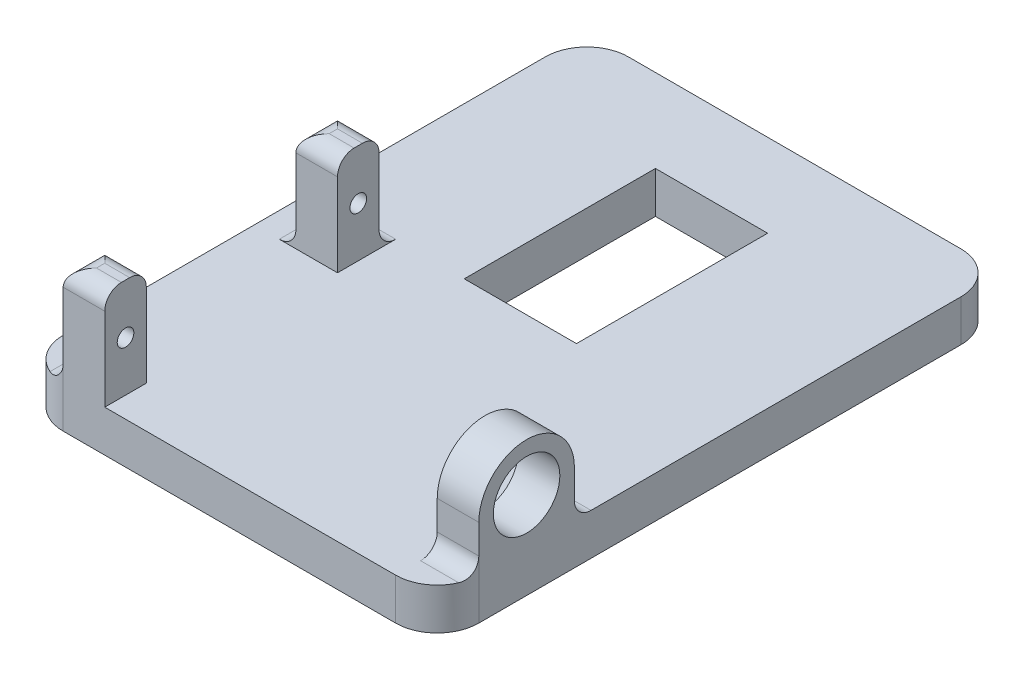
ISO-10303-21;
HEADER;
FILE_DESCRIPTION(('STEP AP214'),'2;1');
FILE_NAME('part.step','',(''),(''),'','','');
FILE_SCHEMA(('AUTOMOTIVE_DESIGN { 1 0 10303 214 1 1 1 1 }'));
ENDSEC;
DATA;
#1=APPLICATION_CONTEXT('core data for automotive mechanical design processes');
#2=APPLICATION_PROTOCOL_DEFINITION('international standard','automotive_design',2000,#1);
#3=PRODUCT_CONTEXT('',#1,'mechanical');
#4=PRODUCT('Part','Part','',(#3));
#5=PRODUCT_RELATED_PRODUCT_CATEGORY('part','',(#4));
#6=PRODUCT_DEFINITION_FORMATION('','',#4);
#7=PRODUCT_DEFINITION_CONTEXT('part definition',#1,'design');
#8=PRODUCT_DEFINITION('design','',#6,#7);
#9=PRODUCT_DEFINITION_SHAPE('','',#8);
#10=(LENGTH_UNIT() NAMED_UNIT(*) SI_UNIT(.MILLI.,.METRE.));
#11=(NAMED_UNIT(*) PLANE_ANGLE_UNIT() SI_UNIT($,.RADIAN.));
#12=(NAMED_UNIT(*) SI_UNIT($,.STERADIAN.) SOLID_ANGLE_UNIT());
#13=UNCERTAINTY_MEASURE_WITH_UNIT(LENGTH_MEASURE(1.E-05),#10,'distance_accuracy_value','');
#14=(GEOMETRIC_REPRESENTATION_CONTEXT(3) GLOBAL_UNCERTAINTY_ASSIGNED_CONTEXT((#13)) GLOBAL_UNIT_ASSIGNED_CONTEXT((#10,
#11,#12)) REPRESENTATION_CONTEXT('',''));
#15=CARTESIAN_POINT('',(0.,0.,0.));
#16=DIRECTION('',(0.,0.,1.));
#17=DIRECTION('',(1.,0.,0.));
#18=AXIS2_PLACEMENT_3D('',#15,#16,#17);
#19=CARTESIAN_POINT('',(0.,5.,0.));
#20=DIRECTION('',(0.,1.,0.));
#21=DIRECTION('',(0.,0.,1.));
#22=AXIS2_PLACEMENT_3D('',#19,#20,#21);
#23=PLANE('',#22);
#24=CARTESIAN_POINT('',(20.,5.,35.75));
#25=DIRECTION('',(0.,1.,0.));
#26=DIRECTION('',(0.,0.,1.));
#27=AXIS2_PLACEMENT_3D('',#24,#25,#26);
#28=CIRCLE('',#27,5.);
#29=CARTESIAN_POINT('',(20.,5.,40.75));
#30=VERTEX_POINT('',#29);
#31=CARTESIAN_POINT('',(24.5825756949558,5.,37.75));
#32=VERTEX_POINT('',#31);
#33=EDGE_CURVE('E407',#30,#32,#28,.T.);
#34=ORIENTED_EDGE('',*,*,#33,.T.);
#35=DIRECTION('',(1.,0.,0.));
#36=VECTOR('',#35,1.);
#37=CARTESIAN_POINT('',(20.,5.,37.75));
#38=LINE('',#37,#36);
#39=CARTESIAN_POINT('',(20.,5.,37.75));
#40=VERTEX_POINT('',#39);
#41=EDGE_CURVE('E583',#32,#40,#38,.F.);
#42=ORIENTED_EDGE('',*,*,#41,.T.);
#43=DIRECTION('',(0.,0.,-1.));
#44=VECTOR('',#43,1.);
#45=CARTESIAN_POINT('',(20.,5.,35.75));
#46=LINE('',#45,#44);
#47=CARTESIAN_POINT('',(20.,5.,22.25));
#48=VERTEX_POINT('',#47);
#49=EDGE_CURVE('E248',#40,#48,#46,.T.);
#50=ORIENTED_EDGE('',*,*,#49,.T.);
#51=DIRECTION('',(1.,0.,0.));
#52=VECTOR('',#51,1.);
#53=CARTESIAN_POINT('',(25.,5.,22.25));
#54=LINE('',#53,#52);
#55=CARTESIAN_POINT('',(25.,5.,22.25));
#56=VERTEX_POINT('',#55);
#57=EDGE_CURVE('E581',#48,#56,#54,.T.);
#58=ORIENTED_EDGE('',*,*,#57,.T.);
#59=DIRECTION('',(0.,0.,-1.));
#60=VECTOR('',#59,1.);
#61=CARTESIAN_POINT('',(25.,5.,-27.25));
#62=LINE('',#61,#60);
#63=CARTESIAN_POINT('',(25.,5.,-22.25));
#64=VERTEX_POINT('',#63);
#65=EDGE_CURVE('E359',#56,#64,#62,.T.);
#66=ORIENTED_EDGE('',*,*,#65,.T.);
#67=CARTESIAN_POINT('',(20.,5.,-22.25));
#68=DIRECTION('',(0.,1.,0.));
#69=DIRECTION('',(0.,0.,1.));
#70=AXIS2_PLACEMENT_3D('',#67,#68,#69);
#71=CIRCLE('',#70,5.);
#72=CARTESIAN_POINT('',(20.,5.,-27.25));
#73=VERTEX_POINT('',#72);
#74=EDGE_CURVE('E402',#64,#73,#71,.T.);
#75=ORIENTED_EDGE('',*,*,#74,.T.);
#76=DIRECTION('',(-1.,0.,0.));
#77=VECTOR('',#76,1.);
#78=CARTESIAN_POINT('',(-25.,5.,-27.25));
#79=LINE('',#78,#77);
#80=CARTESIAN_POINT('',(-20.,5.,-27.25));
#81=VERTEX_POINT('',#80);
#82=EDGE_CURVE('E361',#73,#81,#79,.T.);
#83=ORIENTED_EDGE('',*,*,#82,.T.);
#84=CARTESIAN_POINT('',(-20.,5.,-22.25));
#85=DIRECTION('',(0.,1.,0.));
#86=DIRECTION('',(0.,0.,1.));
#87=AXIS2_PLACEMENT_3D('',#84,#85,#86);
#88=CIRCLE('',#87,5.);
#89=CARTESIAN_POINT('',(-25.,5.,-22.25));
#90=VERTEX_POINT('',#89);
#91=EDGE_CURVE('E400',#81,#90,#88,.T.);
#92=ORIENTED_EDGE('',*,*,#91,.T.);
#93=DIRECTION('',(0.,0.,1.));
#94=VECTOR('',#93,1.);
#95=CARTESIAN_POINT('',(-25.,5.,-27.25));
#96=LINE('',#95,#94);
#97=CARTESIAN_POINT('',(-25.,5.,35.75));
#98=VERTEX_POINT('',#97);
#99=EDGE_CURVE('E365',#90,#98,#96,.T.);
#100=ORIENTED_EDGE('',*,*,#99,.T.);
#101=CARTESIAN_POINT('',(-20.,5.,35.75));
#102=DIRECTION('',(0.,1.,0.));
#103=DIRECTION('',(0.,0.,1.));
#104=AXIS2_PLACEMENT_3D('',#101,#102,#103);
#105=CIRCLE('',#104,5.);
#106=CARTESIAN_POINT('',(-22.,5.,40.3325756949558));
#107=VERTEX_POINT('',#106);
#108=EDGE_CURVE('E404',#98,#107,#105,.T.);
#109=ORIENTED_EDGE('',*,*,#108,.T.);
#110=DIRECTION('',(0.,0.,1.));
#111=VECTOR('',#110,1.);
#112=CARTESIAN_POINT('',(-22.,5.,35.75));
#113=LINE('',#112,#111);
#114=CARTESIAN_POINT('',(-22.,5.,35.75));
#115=VERTEX_POINT('',#114);
#116=EDGE_CURVE('E461',#107,#115,#113,.F.);
#117=ORIENTED_EDGE('',*,*,#116,.T.);
#118=DIRECTION('',(1.,0.,0.));
#119=VECTOR('',#118,1.);
#120=CARTESIAN_POINT('',(-20.,5.,35.75));
#121=LINE('',#120,#119);
#122=CARTESIAN_POINT('',(-15.,5.,35.75));
#123=VERTEX_POINT('',#122);
#124=EDGE_CURVE('E274',#115,#123,#121,.T.);
#125=ORIENTED_EDGE('',*,*,#124,.T.);
#126=DIRECTION('',(0.,0.,1.));
#127=VECTOR('',#126,1.);
#128=CARTESIAN_POINT('',(-15.,5.,35.75));
#129=LINE('',#128,#127);
#130=CARTESIAN_POINT('',(-15.,5.,40.75));
#131=VERTEX_POINT('',#130);
#132=EDGE_CURVE('E279',#123,#131,#129,.T.);
#133=ORIENTED_EDGE('',*,*,#132,.T.);
#134=DIRECTION('',(1.,0.,0.));
#135=VECTOR('',#134,1.);
#136=CARTESIAN_POINT('',(-25.,5.,40.75));
#137=LINE('',#136,#135);
#138=EDGE_CURVE('E368',#131,#30,#137,.T.);
#139=ORIENTED_EDGE('',*,*,#138,.T.);
#140=EDGE_LOOP('',(#34,#42,#50,#58,#66,#75,#83,#92,#100,#109,#117,#125,#133,#139));
#141=FACE_BOUND('',#140,.T.);
#142=DIRECTION('',(-1.,0.,0.));
#143=VECTOR('',#142,1.);
#144=CARTESIAN_POINT('',(-6.75,5.,-17.25));
#145=LINE('',#144,#143);
#146=CARTESIAN_POINT('',(6.75,5.,-17.25));
#147=VERTEX_POINT('',#146);
#148=CARTESIAN_POINT('',(-6.75,5.,-17.25));
#149=VERTEX_POINT('',#148);
#150=EDGE_CURVE('E330',#147,#149,#145,.T.);
#151=ORIENTED_EDGE('',*,*,#150,.F.);
#152=DIRECTION('',(0.,0.,-1.));
#153=VECTOR('',#152,1.);
#154=CARTESIAN_POINT('',(6.75,5.,-17.25));
#155=LINE('',#154,#153);
#156=CARTESIAN_POINT('',(6.75,5.,5.75));
#157=VERTEX_POINT('',#156);
#158=EDGE_CURVE('E328',#157,#147,#155,.T.);
#159=ORIENTED_EDGE('',*,*,#158,.F.);
#160=DIRECTION('',(1.,0.,0.));
#161=VECTOR('',#160,1.);
#162=CARTESIAN_POINT('',(-6.75,5.,5.75));
#163=LINE('',#162,#161);
#164=CARTESIAN_POINT('',(-6.75,5.,5.75));
#165=VERTEX_POINT('',#164);
#166=EDGE_CURVE('E336',#165,#157,#163,.T.);
#167=ORIENTED_EDGE('',*,*,#166,.F.);
#168=DIRECTION('',(0.,0.,1.));
#169=VECTOR('',#168,1.);
#170=CARTESIAN_POINT('',(-6.75,5.,-17.25));
#171=LINE('',#170,#169);
#172=EDGE_CURVE('E333',#149,#165,#171,.T.);
#173=ORIENTED_EDGE('',*,*,#172,.F.);
#174=EDGE_LOOP('',(#151,#159,#167,#173));
#175=FACE_BOUND('',#174,.T.);
#176=DIRECTION('',(1.,0.,0.));
#177=VECTOR('',#176,1.);
#178=CARTESIAN_POINT('',(0.,5.,5.75));
#179=LINE('',#178,#177);
#180=CARTESIAN_POINT('',(-22.,5.,5.75));
#181=VERTEX_POINT('',#180);
#182=CARTESIAN_POINT('',(-15.,5.,5.75));
#183=VERTEX_POINT('',#182);
#184=EDGE_CURVE('E466',#181,#183,#179,.T.);
#185=ORIENTED_EDGE('',*,*,#184,.T.);
#186=DIRECTION('',(0.,0.,1.));
#187=VECTOR('',#186,1.);
#188=CARTESIAN_POINT('',(-15.,5.,7.75));
#189=LINE('',#188,#187);
#190=CARTESIAN_POINT('',(-15.,5.,12.75));
#191=VERTEX_POINT('',#190);
#192=EDGE_CURVE('E312',#183,#191,#189,.T.);
#193=ORIENTED_EDGE('',*,*,#192,.T.);
#194=DIRECTION('',(1.,0.,0.));
#195=VECTOR('',#194,1.);
#196=CARTESIAN_POINT('',(-20.,5.,12.75));
#197=LINE('',#196,#195);
#198=CARTESIAN_POINT('',(-22.,5.,12.75));
#199=VERTEX_POINT('',#198);
#200=EDGE_CURVE('E315',#199,#191,#197,.T.);
#201=ORIENTED_EDGE('',*,*,#200,.F.);
#202=DIRECTION('',(0.,0.,1.));
#203=VECTOR('',#202,1.);
#204=CARTESIAN_POINT('',(-22.,5.,7.75));
#205=LINE('',#204,#203);
#206=EDGE_CURVE('E464',#199,#181,#205,.F.);
#207=ORIENTED_EDGE('',*,*,#206,.T.);
#208=EDGE_LOOP('',(#185,#193,#201,#207));
#209=FACE_BOUND('',#208,.T.);
#210=ADVANCED_FACE('F39',(#141,#175,#209),#23,.T.);
#211=CARTESIAN_POINT('',(0.,0.,0.));
#212=DIRECTION('',(0.,1.,0.));
#213=DIRECTION('',(0.,0.,1.));
#214=AXIS2_PLACEMENT_3D('',#211,#212,#213);
#215=PLANE('',#214);
#216=DIRECTION('',(0.,0.,-1.));
#217=VECTOR('',#216,1.);
#218=CARTESIAN_POINT('',(25.,0.,-27.25));
#219=LINE('',#218,#217);
#220=CARTESIAN_POINT('',(25.,0.,35.75));
#221=VERTEX_POINT('',#220);
#222=CARTESIAN_POINT('',(25.,0.,-22.25));
#223=VERTEX_POINT('',#222);
#224=EDGE_CURVE('E358',#221,#223,#219,.T.);
#225=ORIENTED_EDGE('',*,*,#224,.F.);
#226=CARTESIAN_POINT('',(20.,0.,35.75));
#227=DIRECTION('',(0.,1.,0.));
#228=DIRECTION('',(0.,0.,1.));
#229=AXIS2_PLACEMENT_3D('',#226,#227,#228);
#230=CIRCLE('',#229,5.);
#231=CARTESIAN_POINT('',(20.,0.,40.75));
#232=VERTEX_POINT('',#231);
#233=EDGE_CURVE('E392',#221,#232,#230,.F.);
#234=ORIENTED_EDGE('',*,*,#233,.T.);
#235=DIRECTION('',(1.,0.,0.));
#236=VECTOR('',#235,1.);
#237=CARTESIAN_POINT('',(-25.,0.,40.75));
#238=LINE('',#237,#236);
#239=CARTESIAN_POINT('',(-20.,0.,40.75));
#240=VERTEX_POINT('',#239);
#241=EDGE_CURVE('E362',#240,#232,#238,.T.);
#242=ORIENTED_EDGE('',*,*,#241,.F.);
#243=CARTESIAN_POINT('',(-20.,0.,35.75));
#244=DIRECTION('',(0.,1.,0.));
#245=DIRECTION('',(0.,0.,1.));
#246=AXIS2_PLACEMENT_3D('',#243,#244,#245);
#247=CIRCLE('',#246,5.);
#248=CARTESIAN_POINT('',(-25.,0.,35.75));
#249=VERTEX_POINT('',#248);
#250=EDGE_CURVE('E390',#240,#249,#247,.F.);
#251=ORIENTED_EDGE('',*,*,#250,.T.);
#252=DIRECTION('',(0.,0.,1.));
#253=VECTOR('',#252,1.);
#254=CARTESIAN_POINT('',(-25.,0.,-27.25));
#255=LINE('',#254,#253);
#256=CARTESIAN_POINT('',(-25.,0.,-22.25));
#257=VERTEX_POINT('',#256);
#258=EDGE_CURVE('E376',#257,#249,#255,.T.);
#259=ORIENTED_EDGE('',*,*,#258,.F.);
#260=CARTESIAN_POINT('',(-20.,0.,-22.25));
#261=DIRECTION('',(0.,1.,0.));
#262=DIRECTION('',(0.,0.,1.));
#263=AXIS2_PLACEMENT_3D('',#260,#261,#262);
#264=CIRCLE('',#263,5.);
#265=CARTESIAN_POINT('',(-20.,0.,-27.25));
#266=VERTEX_POINT('',#265);
#267=EDGE_CURVE('E386',#257,#266,#264,.F.);
#268=ORIENTED_EDGE('',*,*,#267,.T.);
#269=DIRECTION('',(-1.,0.,0.));
#270=VECTOR('',#269,1.);
#271=CARTESIAN_POINT('',(-25.,0.,-27.25));
#272=LINE('',#271,#270);
#273=CARTESIAN_POINT('',(20.,0.,-27.25));
#274=VERTEX_POINT('',#273);
#275=EDGE_CURVE('E373',#274,#266,#272,.T.);
#276=ORIENTED_EDGE('',*,*,#275,.F.);
#277=CARTESIAN_POINT('',(20.,0.,-22.25));
#278=DIRECTION('',(0.,1.,0.));
#279=DIRECTION('',(0.,0.,1.));
#280=AXIS2_PLACEMENT_3D('',#277,#278,#279);
#281=CIRCLE('',#280,5.);
#282=EDGE_CURVE('E388',#274,#223,#281,.F.);
#283=ORIENTED_EDGE('',*,*,#282,.T.);
#284=EDGE_LOOP('',(#225,#234,#242,#251,#259,#268,#276,#283));
#285=FACE_BOUND('',#284,.T.);
#286=DIRECTION('',(0.,0.,-1.));
#287=VECTOR('',#286,1.);
#288=CARTESIAN_POINT('',(6.75,0.,-17.25));
#289=LINE('',#288,#287);
#290=CARTESIAN_POINT('',(6.75,0.,5.75));
#291=VERTEX_POINT('',#290);
#292=CARTESIAN_POINT('',(6.75,0.,-17.25));
#293=VERTEX_POINT('',#292);
#294=EDGE_CURVE('E327',#291,#293,#289,.T.);
#295=ORIENTED_EDGE('',*,*,#294,.T.);
#296=DIRECTION('',(-1.,0.,0.));
#297=VECTOR('',#296,1.);
#298=CARTESIAN_POINT('',(-6.75,0.,-17.25));
#299=LINE('',#298,#297);
#300=CARTESIAN_POINT('',(-6.75,0.,-17.25));
#301=VERTEX_POINT('',#300);
#302=EDGE_CURVE('E341',#293,#301,#299,.T.);
#303=ORIENTED_EDGE('',*,*,#302,.T.);
#304=DIRECTION('',(0.,0.,1.));
#305=VECTOR('',#304,1.);
#306=CARTESIAN_POINT('',(-6.75,0.,-17.25));
#307=LINE('',#306,#305);
#308=CARTESIAN_POINT('',(-6.75,0.,5.75));
#309=VERTEX_POINT('',#308);
#310=EDGE_CURVE('E344',#301,#309,#307,.T.);
#311=ORIENTED_EDGE('',*,*,#310,.T.);
#312=DIRECTION('',(1.,0.,0.));
#313=VECTOR('',#312,1.);
#314=CARTESIAN_POINT('',(-6.75,0.,5.75));
#315=LINE('',#314,#313);
#316=EDGE_CURVE('E331',#309,#291,#315,.T.);
#317=ORIENTED_EDGE('',*,*,#316,.T.);
#318=EDGE_LOOP('',(#295,#303,#311,#317));
#319=FACE_BOUND('',#318,.T.);
#320=ADVANCED_FACE('F540',(#285,#319),#215,.F.);
#321=CARTESIAN_POINT('',(25.,5.,-27.25));
#322=DIRECTION('',(-1.,0.,0.));
#323=DIRECTION('',(0.,0.,1.));
#324=AXIS2_PLACEMENT_3D('',#321,#322,#323);
#325=PLANE('',#324);
#326=ORIENTED_EDGE('',*,*,#65,.F.);
#327=CARTESIAN_POINT('',(25.,7.,22.25));
#328=DIRECTION('',(-1.,0.,0.));
#329=DIRECTION('',(0.,0.,1.));
#330=AXIS2_PLACEMENT_3D('',#327,#328,#329);
#331=CIRCLE('',#330,2.);
#332=CARTESIAN_POINT('',(25.,7.,24.25));
#333=VERTEX_POINT('',#332);
#334=EDGE_CURVE('E48',#56,#333,#331,.T.);
#335=ORIENTED_EDGE('',*,*,#334,.T.);
#336=DIRECTION('',(0.,1.,0.));
#337=VECTOR('',#336,1.);
#338=CARTESIAN_POINT('',(25.,5.,24.25));
#339=LINE('',#338,#337);
#340=CARTESIAN_POINT('',(25.,10.5,24.25));
#341=VERTEX_POINT('',#340);
#342=EDGE_CURVE('E265',#333,#341,#339,.T.);
#343=ORIENTED_EDGE('',*,*,#342,.T.);
#344=CARTESIAN_POINT('',(25.,10.5,30.));
#345=DIRECTION('',(1.,0.,0.));
#346=DIRECTION('',(0.,0.,1.));
#347=AXIS2_PLACEMENT_3D('',#344,#345,#346);
#348=CIRCLE('',#347,5.75);
#349=CARTESIAN_POINT('',(25.,10.5,35.75));
#350=VERTEX_POINT('',#349);
#351=EDGE_CURVE('E255',#341,#350,#348,.T.);
#352=ORIENTED_EDGE('',*,*,#351,.T.);
#353=DIRECTION('',(0.,-1.,0.));
#354=VECTOR('',#353,1.);
#355=CARTESIAN_POINT('',(25.,5.,35.75));
#356=LINE('',#355,#354);
#357=CARTESIAN_POINT('',(25.,7.,35.75));
#358=VERTEX_POINT('',#357);
#359=EDGE_CURVE('E269',#350,#358,#356,.T.);
#360=ORIENTED_EDGE('',*,*,#359,.T.);
#361=DIRECTION('',(0.,-1.,0.));
#362=VECTOR('',#361,1.);
#363=CARTESIAN_POINT('',(25.,5.,35.75));
#364=LINE('',#363,#362);
#365=EDGE_CURVE('E383',#358,#221,#364,.T.);
#366=ORIENTED_EDGE('',*,*,#365,.T.);
#367=ORIENTED_EDGE('',*,*,#224,.T.);
#368=DIRECTION('',(0.,-1.,0.));
#369=VECTOR('',#368,1.);
#370=CARTESIAN_POINT('',(25.,5.,-22.25));
#371=LINE('',#370,#369);
#372=EDGE_CURVE('E370',#223,#64,#371,.F.);
#373=ORIENTED_EDGE('',*,*,#372,.T.);
#374=EDGE_LOOP('',(#326,#335,#343,#352,#360,#366,#367,#373));
#375=FACE_BOUND('',#374,.T.);
#376=CARTESIAN_POINT('',(25.,10.5,30.));
#377=DIRECTION('',(1.,0.,0.));
#378=DIRECTION('',(0.,0.,-1.));
#379=AXIS2_PLACEMENT_3D('',#376,#377,#378);
#380=CIRCLE('',#379,4.);
#381=CARTESIAN_POINT('',(25.,10.5,26.));
#382=VERTEX_POINT('',#381);
#383=EDGE_CURVE('E573',#382,#382,#380,.T.);
#384=ORIENTED_EDGE('',*,*,#383,.F.);
#385=EDGE_LOOP('',(#384));
#386=FACE_BOUND('',#385,.T.);
#387=ADVANCED_FACE('F546',(#375,#386),#325,.F.);
#388=CARTESIAN_POINT('',(-25.,5.,-27.25));
#389=DIRECTION('',(0.,0.,1.));
#390=DIRECTION('',(1.,0.,0.));
#391=AXIS2_PLACEMENT_3D('',#388,#389,#390);
#392=PLANE('',#391);
#393=ORIENTED_EDGE('',*,*,#82,.F.);
#394=DIRECTION('',(0.,-1.,0.));
#395=VECTOR('',#394,1.);
#396=CARTESIAN_POINT('',(20.,5.,-27.25));
#397=LINE('',#396,#395);
#398=EDGE_CURVE('E417',#73,#274,#397,.T.);
#399=ORIENTED_EDGE('',*,*,#398,.T.);
#400=ORIENTED_EDGE('',*,*,#275,.T.);
#401=DIRECTION('',(0.,-1.,0.));
#402=VECTOR('',#401,1.);
#403=CARTESIAN_POINT('',(-20.,5.,-27.25));
#404=LINE('',#403,#402);
#405=EDGE_CURVE('E415',#266,#81,#404,.F.);
#406=ORIENTED_EDGE('',*,*,#405,.T.);
#407=EDGE_LOOP('',(#393,#399,#400,#406));
#408=FACE_BOUND('',#407,.T.);
#409=ADVANCED_FACE('F561',(#408),#392,.F.);
#410=CARTESIAN_POINT('',(-25.,5.,-27.25));
#411=DIRECTION('',(1.,0.,0.));
#412=DIRECTION('',(0.,0.,-1.));
#413=AXIS2_PLACEMENT_3D('',#410,#411,#412);
#414=PLANE('',#413);
#415=ORIENTED_EDGE('',*,*,#258,.T.);
#416=DIRECTION('',(0.,-1.,0.));
#417=VECTOR('',#416,1.);
#418=CARTESIAN_POINT('',(-25.,5.,35.75));
#419=LINE('',#418,#417);
#420=EDGE_CURVE('E413',#249,#98,#419,.F.);
#421=ORIENTED_EDGE('',*,*,#420,.T.);
#422=ORIENTED_EDGE('',*,*,#99,.F.);
#423=DIRECTION('',(0.,-1.,0.));
#424=VECTOR('',#423,1.);
#425=CARTESIAN_POINT('',(-25.,5.,-22.25));
#426=LINE('',#425,#424);
#427=EDGE_CURVE('E410',#90,#257,#426,.T.);
#428=ORIENTED_EDGE('',*,*,#427,.T.);
#429=EDGE_LOOP('',(#415,#421,#422,#428));
#430=FACE_BOUND('',#429,.T.);
#431=ADVANCED_FACE('F557',(#430),#414,.F.);
#432=CARTESIAN_POINT('',(-25.,5.,40.75));
#433=DIRECTION('',(0.,0.,-1.));
#434=DIRECTION('',(-1.,0.,0.));
#435=AXIS2_PLACEMENT_3D('',#432,#433,#434);
#436=PLANE('',#435);
#437=DIRECTION('',(0.,1.,0.));
#438=VECTOR('',#437,1.);
#439=CARTESIAN_POINT('',(-15.,17.,40.75));
#440=LINE('',#439,#438);
#441=CARTESIAN_POINT('',(-15.,15.,40.75));
#442=VERTEX_POINT('',#441);
#443=EDGE_CURVE('E288',#131,#442,#440,.T.);
#444=ORIENTED_EDGE('',*,*,#443,.T.);
#445=DIRECTION('',(1.,0.,0.));
#446=VECTOR('',#445,1.);
#447=CARTESIAN_POINT('',(-25.,15.,40.75));
#448=LINE('',#447,#446);
#449=CARTESIAN_POINT('',(-20.,15.,40.75));
#450=VERTEX_POINT('',#449);
#451=EDGE_CURVE('E450',#442,#450,#448,.F.);
#452=ORIENTED_EDGE('',*,*,#451,.T.);
#453=DIRECTION('',(0.,1.,0.));
#454=VECTOR('',#453,1.);
#455=CARTESIAN_POINT('',(-20.,17.,40.75));
#456=LINE('',#455,#454);
#457=CARTESIAN_POINT('',(-20.,7.,40.75));
#458=VERTEX_POINT('',#457);
#459=EDGE_CURVE('E283',#458,#450,#456,.T.);
#460=ORIENTED_EDGE('',*,*,#459,.F.);
#461=DIRECTION('',(0.,-1.,0.));
#462=VECTOR('',#461,1.);
#463=CARTESIAN_POINT('',(-20.,5.,40.75));
#464=LINE('',#463,#462);
#465=EDGE_CURVE('E394',#458,#240,#464,.T.);
#466=ORIENTED_EDGE('',*,*,#465,.T.);
#467=ORIENTED_EDGE('',*,*,#241,.T.);
#468=DIRECTION('',(0.,-1.,0.));
#469=VECTOR('',#468,1.);
#470=CARTESIAN_POINT('',(20.,5.,40.75));
#471=LINE('',#470,#469);
#472=EDGE_CURVE('E397',#232,#30,#471,.F.);
#473=ORIENTED_EDGE('',*,*,#472,.T.);
#474=ORIENTED_EDGE('',*,*,#138,.F.);
#475=EDGE_LOOP('',(#444,#452,#460,#466,#467,#473,#474));
#476=FACE_BOUND('',#475,.T.);
#477=ADVANCED_FACE('F554',(#476),#436,.F.);
#478=CARTESIAN_POINT('',(6.75,5.,-17.25));
#479=DIRECTION('',(-1.,0.,0.));
#480=DIRECTION('',(0.,0.,1.));
#481=AXIS2_PLACEMENT_3D('',#478,#479,#480);
#482=PLANE('',#481);
#483=ORIENTED_EDGE('',*,*,#294,.F.);
#484=DIRECTION('',(0.,-1.,0.));
#485=VECTOR('',#484,1.);
#486=CARTESIAN_POINT('',(6.75,5.,5.75));
#487=LINE('',#486,#485);
#488=EDGE_CURVE('E338',#157,#291,#487,.T.);
#489=ORIENTED_EDGE('',*,*,#488,.F.);
#490=ORIENTED_EDGE('',*,*,#158,.T.);
#491=DIRECTION('',(0.,-1.,0.));
#492=VECTOR('',#491,1.);
#493=CARTESIAN_POINT('',(6.75,5.,-17.25));
#494=LINE('',#493,#492);
#495=EDGE_CURVE('E355',#147,#293,#494,.T.);
#496=ORIENTED_EDGE('',*,*,#495,.T.);
#497=EDGE_LOOP('',(#483,#489,#490,#496));
#498=FACE_BOUND('',#497,.T.);
#499=ADVANCED_FACE('F551',(#498),#482,.T.);
#500=CARTESIAN_POINT('',(-6.75,5.,-17.25));
#501=DIRECTION('',(0.,0.,1.));
#502=DIRECTION('',(1.,0.,0.));
#503=AXIS2_PLACEMENT_3D('',#500,#501,#502);
#504=PLANE('',#503);
#505=ORIENTED_EDGE('',*,*,#302,.F.);
#506=ORIENTED_EDGE('',*,*,#495,.F.);
#507=ORIENTED_EDGE('',*,*,#150,.T.);
#508=DIRECTION('',(0.,-1.,0.));
#509=VECTOR('',#508,1.);
#510=CARTESIAN_POINT('',(-6.75,5.,-17.25));
#511=LINE('',#510,#509);
#512=EDGE_CURVE('E353',#149,#301,#511,.T.);
#513=ORIENTED_EDGE('',*,*,#512,.T.);
#514=EDGE_LOOP('',(#505,#506,#507,#513));
#515=FACE_BOUND('',#514,.T.);
#516=ADVANCED_FACE('F726',(#515),#504,.T.);
#517=CARTESIAN_POINT('',(-6.75,5.,-17.25));
#518=DIRECTION('',(1.,0.,0.));
#519=DIRECTION('',(0.,0.,-1.));
#520=AXIS2_PLACEMENT_3D('',#517,#518,#519);
#521=PLANE('',#520);
#522=ORIENTED_EDGE('',*,*,#310,.F.);
#523=ORIENTED_EDGE('',*,*,#512,.F.);
#524=ORIENTED_EDGE('',*,*,#172,.T.);
#525=DIRECTION('',(0.,-1.,0.));
#526=VECTOR('',#525,1.);
#527=CARTESIAN_POINT('',(-6.75,5.,5.75));
#528=LINE('',#527,#526);
#529=EDGE_CURVE('E351',#165,#309,#528,.T.);
#530=ORIENTED_EDGE('',*,*,#529,.T.);
#531=EDGE_LOOP('',(#522,#523,#524,#530));
#532=FACE_BOUND('',#531,.T.);
#533=ADVANCED_FACE('F723',(#532),#521,.T.);
#534=CARTESIAN_POINT('',(-6.75,5.,5.75));
#535=DIRECTION('',(0.,0.,-1.));
#536=DIRECTION('',(-1.,0.,0.));
#537=AXIS2_PLACEMENT_3D('',#534,#535,#536);
#538=PLANE('',#537);
#539=ORIENTED_EDGE('',*,*,#316,.F.);
#540=ORIENTED_EDGE('',*,*,#529,.F.);
#541=ORIENTED_EDGE('',*,*,#166,.T.);
#542=ORIENTED_EDGE('',*,*,#488,.T.);
#543=EDGE_LOOP('',(#539,#540,#541,#542));
#544=FACE_BOUND('',#543,.T.);
#545=ADVANCED_FACE('F720',(#544),#538,.T.);
#546=CARTESIAN_POINT('',(20.,5.,35.75));
#547=DIRECTION('',(0.,-1.,0.));
#548=DIRECTION('',(0.,0.,-1.));
#549=AXIS2_PLACEMENT_3D('',#546,#547,#548);
#550=CYLINDRICAL_SURFACE('',#549,5.);
#551=ORIENTED_EDGE('',*,*,#33,.F.);
#552=ORIENTED_EDGE('',*,*,#472,.F.);
#553=ORIENTED_EDGE('',*,*,#233,.F.);
#554=ORIENTED_EDGE('',*,*,#365,.F.);
#555=CARTESIAN_POINT('',(25.,7.,35.75));
#556=CARTESIAN_POINT('',(24.9999945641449,6.94381975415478,35.7500003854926));
#557=CARTESIAN_POINT('',(25.0000006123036,6.88766639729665,35.7523686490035));
#558=CARTESIAN_POINT('',(24.9999893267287,6.77575987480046,35.761816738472));
#559=CARTESIAN_POINT('',(24.9999719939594,6.72000669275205,35.7688963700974));
#560=CARTESIAN_POINT('',(24.999815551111,6.55401109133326,35.7971406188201));
#561=CARTESIAN_POINT('',(24.9995722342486,6.44487749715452,35.8253107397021));
#562=CARTESIAN_POINT('',(24.9978992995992,6.23287707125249,35.8995512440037));
#563=CARTESIAN_POINT('',(24.996469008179,6.13001383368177,35.945631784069));
#564=CARTESIAN_POINT('',(24.9910237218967,5.93351442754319,36.054357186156));
#565=CARTESIAN_POINT('',(24.9870091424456,5.83987677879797,36.1169993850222));
#566=CARTESIAN_POINT('',(24.9747701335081,5.66516312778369,36.2564730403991));
#567=CARTESIAN_POINT('',(24.9665737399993,5.58400809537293,36.3332078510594));
#568=CARTESIAN_POINT('',(24.9443437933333,5.43593255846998,36.4986005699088));
#569=CARTESIAN_POINT('',(24.9303128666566,5.36900566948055,36.587253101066));
#570=CARTESIAN_POINT('',(24.8955436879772,5.25278631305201,36.7708507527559));
#571=CARTESIAN_POINT('',(24.8749955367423,5.20306881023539,36.8655631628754));
#572=CARTESIAN_POINT('',(24.8263592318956,5.11978805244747,37.060073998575));
#573=CARTESIAN_POINT('',(24.7982675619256,5.08623235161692,37.1598747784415));
#574=CARTESIAN_POINT('',(24.7405118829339,5.04021672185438,37.3421369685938));
#575=CARTESIAN_POINT('',(24.7121425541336,5.02497245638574,37.4243204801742));
#576=CARTESIAN_POINT('',(24.6660878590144,5.00989256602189,37.5470912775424));
#577=CARTESIAN_POINT('',(24.6501655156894,5.00616357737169,37.5879017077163));
#578=CARTESIAN_POINT('',(24.6171996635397,5.00121713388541,37.6692172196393));
#579=CARTESIAN_POINT('',(24.6001562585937,4.99999944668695,37.7097223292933));
#580=CARTESIAN_POINT('',(24.5825756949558,5.,37.75));
#581=B_SPLINE_CURVE_WITH_KNOTS('',3,(#555,#556,#557,#558,#559,#560,#561,#562,#563,#564,#565,
#566,#567,#568,#569,#570,#571,#572,#573,#574,#575,#576,#577,#578,#579,#580),.UNSPECIFIED.,.F.,
.F.,(4,2,2,2,2,2,2,2,2,2,2,2,4),(0.,0.1684374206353,0.336867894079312,0.673269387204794,
1.00986192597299,1.346400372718,1.68071165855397,2.01487261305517,2.34006609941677,
2.66541143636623,2.92942559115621,3.06124371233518,3.19304963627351),.UNSPECIFIED.);
#582=EDGE_CURVE('E594',#358,#32,#581,.T.);
#583=ORIENTED_EDGE('',*,*,#582,.T.);
#584=EDGE_LOOP('',(#551,#552,#553,#554,#583));
#585=FACE_BOUND('',#584,.T.);
#586=ADVANCED_FACE('F493',(#585),#550,.T.);
#587=CARTESIAN_POINT('',(-20.,5.,35.75));
#588=DIRECTION('',(0.,-1.,0.));
#589=DIRECTION('',(0.,0.,-1.));
#590=AXIS2_PLACEMENT_3D('',#587,#588,#589);
#591=CYLINDRICAL_SURFACE('',#590,5.);
#592=ORIENTED_EDGE('',*,*,#108,.F.);
#593=ORIENTED_EDGE('',*,*,#420,.F.);
#594=ORIENTED_EDGE('',*,*,#250,.F.);
#595=ORIENTED_EDGE('',*,*,#465,.F.);
#596=CARTESIAN_POINT('',(-20.,7.,40.75));
#597=CARTESIAN_POINT('',(-20.0000003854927,6.94381975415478,40.7499945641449));
#598=CARTESIAN_POINT('',(-20.0023686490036,6.88766639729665,40.7500006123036));
#599=CARTESIAN_POINT('',(-20.011816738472,6.77575987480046,40.7499893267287));
#600=CARTESIAN_POINT('',(-20.0188963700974,6.72000669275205,40.7499719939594));
#601=CARTESIAN_POINT('',(-20.0471406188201,6.55401109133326,40.749815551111));
#602=CARTESIAN_POINT('',(-20.0753107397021,6.44487749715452,40.7495722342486));
#603=CARTESIAN_POINT('',(-20.1495512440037,6.23287707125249,40.7478992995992));
#604=CARTESIAN_POINT('',(-20.195631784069,6.13001383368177,40.746469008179));
#605=CARTESIAN_POINT('',(-20.304357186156,5.93351442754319,40.7410237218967));
#606=CARTESIAN_POINT('',(-20.3669993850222,5.83987677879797,40.7370091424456));
#607=CARTESIAN_POINT('',(-20.5064730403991,5.66516312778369,40.7247701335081));
#608=CARTESIAN_POINT('',(-20.5832078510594,5.58400809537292,40.7165737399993));
#609=CARTESIAN_POINT('',(-20.7486005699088,5.43593255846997,40.6943437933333));
#610=CARTESIAN_POINT('',(-20.837253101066,5.36900566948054,40.6803128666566));
#611=CARTESIAN_POINT('',(-21.0208507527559,5.25278631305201,40.6455436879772));
#612=CARTESIAN_POINT('',(-21.1155631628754,5.20306881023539,40.6249955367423));
#613=CARTESIAN_POINT('',(-21.310073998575,5.11978805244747,40.5763592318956));
#614=CARTESIAN_POINT('',(-21.4098747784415,5.08623235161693,40.5482675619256));
#615=CARTESIAN_POINT('',(-21.5921369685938,5.04021672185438,40.4905118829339));
#616=CARTESIAN_POINT('',(-21.6743204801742,5.02497245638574,40.4621425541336));
#617=CARTESIAN_POINT('',(-21.7970912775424,5.00989256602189,40.4160878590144));
#618=CARTESIAN_POINT('',(-21.8379017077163,5.00616357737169,40.4001655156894));
#619=CARTESIAN_POINT('',(-21.9192172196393,5.00121713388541,40.3671996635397));
#620=CARTESIAN_POINT('',(-21.9597223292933,4.99999944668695,40.3501562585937));
#621=CARTESIAN_POINT('',(-22.,5.,40.3325756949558));
#622=B_SPLINE_CURVE_WITH_KNOTS('',3,(#596,#597,#598,#599,#600,#601,#602,#603,#604,#605,#606,
#607,#608,#609,#610,#611,#612,#613,#614,#615,#616,#617,#618,#619,#620,#621),.UNSPECIFIED.,.F.,
.F.,(4,2,2,2,2,2,2,2,2,2,2,2,4),(0.,0.168437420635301,0.336867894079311,0.673269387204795,
1.00986192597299,1.346400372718,1.68071165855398,2.01487261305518,2.34006609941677,
2.66541143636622,2.9294255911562,3.06124371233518,3.1930496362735),.UNSPECIFIED.);
#623=EDGE_CURVE('E474',#458,#107,#622,.T.);
#624=ORIENTED_EDGE('',*,*,#623,.T.);
#625=EDGE_LOOP('',(#592,#593,#594,#595,#624));
#626=FACE_BOUND('',#625,.T.);
#627=ADVANCED_FACE('F487',(#626),#591,.T.);
#628=CARTESIAN_POINT('',(20.,5.,-22.25));
#629=DIRECTION('',(0.,-1.,0.));
#630=DIRECTION('',(0.,0.,-1.));
#631=AXIS2_PLACEMENT_3D('',#628,#629,#630);
#632=CYLINDRICAL_SURFACE('',#631,5.);
#633=ORIENTED_EDGE('',*,*,#74,.F.);
#634=ORIENTED_EDGE('',*,*,#372,.F.);
#635=ORIENTED_EDGE('',*,*,#282,.F.);
#636=ORIENTED_EDGE('',*,*,#398,.F.);
#637=EDGE_LOOP('',(#633,#634,#635,#636));
#638=FACE_BOUND('',#637,.T.);
#639=ADVANCED_FACE('F492',(#638),#632,.T.);
#640=CARTESIAN_POINT('',(-20.,5.,-22.25));
#641=DIRECTION('',(0.,-1.,0.));
#642=DIRECTION('',(0.,0.,-1.));
#643=AXIS2_PLACEMENT_3D('',#640,#641,#642);
#644=CYLINDRICAL_SURFACE('',#643,5.);
#645=ORIENTED_EDGE('',*,*,#91,.F.);
#646=ORIENTED_EDGE('',*,*,#405,.F.);
#647=ORIENTED_EDGE('',*,*,#267,.F.);
#648=ORIENTED_EDGE('',*,*,#427,.F.);
#649=EDGE_LOOP('',(#645,#646,#647,#648));
#650=FACE_BOUND('',#649,.T.);
#651=ADVANCED_FACE('F499',(#650),#644,.T.);
#652=CARTESIAN_POINT('',(-20.,0.,0.));
#653=DIRECTION('',(-1.,0.,0.));
#654=DIRECTION('',(0.,0.,1.));
#655=AXIS2_PLACEMENT_3D('',#652,#653,#654);
#656=PLANE('',#655);
#657=DIRECTION('',(0.,1.,0.));
#658=VECTOR('',#657,1.);
#659=CARTESIAN_POINT('',(-20.,17.,12.75));
#660=LINE('',#659,#658);
#661=CARTESIAN_POINT('',(-20.,7.,12.75));
#662=VERTEX_POINT('',#661);
#663=CARTESIAN_POINT('',(-20.,15.,12.75));
#664=VERTEX_POINT('',#663);
#665=EDGE_CURVE('E308',#662,#664,#660,.T.);
#666=ORIENTED_EDGE('',*,*,#665,.T.);
#667=DIRECTION('',(0.,0.,-1.));
#668=VECTOR('',#667,1.);
#669=CARTESIAN_POINT('',(-20.,15.,7.75));
#670=LINE('',#669,#668);
#671=CARTESIAN_POINT('',(-20.,15.,7.75));
#672=VERTEX_POINT('',#671);
#673=EDGE_CURVE('E459',#664,#672,#670,.T.);
#674=ORIENTED_EDGE('',*,*,#673,.T.);
#675=DIRECTION('',(0.,-1.,0.));
#676=VECTOR('',#675,1.);
#677=CARTESIAN_POINT('',(-20.,17.,7.75));
#678=LINE('',#677,#676);
#679=CARTESIAN_POINT('',(-20.,7.,7.75));
#680=VERTEX_POINT('',#679);
#681=EDGE_CURVE('E311',#672,#680,#678,.T.);
#682=ORIENTED_EDGE('',*,*,#681,.T.);
#683=DIRECTION('',(0.,0.,1.));
#684=VECTOR('',#683,1.);
#685=CARTESIAN_POINT('',(-20.,7.,12.75));
#686=LINE('',#685,#684);
#687=EDGE_CURVE('E457',#680,#662,#686,.T.);
#688=ORIENTED_EDGE('',*,*,#687,.T.);
#689=EDGE_LOOP('',(#666,#674,#682,#688));
#690=FACE_BOUND('',#689,.T.);
#691=CARTESIAN_POINT('',(-20.,11.,10.25));
#692=DIRECTION('',(-1.,0.,0.));
#693=DIRECTION('',(0.,0.,1.));
#694=AXIS2_PLACEMENT_3D('',#691,#692,#693);
#695=CIRCLE('',#694,0.999999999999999);
#696=CARTESIAN_POINT('',(-20.,11.,11.25));
#697=VERTEX_POINT('',#696);
#698=EDGE_CURVE('E302',#697,#697,#695,.T.);
#699=ORIENTED_EDGE('',*,*,#698,.F.);
#700=EDGE_LOOP('',(#699));
#701=FACE_BOUND('',#700,.T.);
#702=ADVANCED_FACE('F503',(#690,#701),#656,.T.);
#703=CARTESIAN_POINT('',(-15.,0.,0.));
#704=DIRECTION('',(-1.,0.,0.));
#705=DIRECTION('',(0.,0.,1.));
#706=AXIS2_PLACEMENT_3D('',#703,#704,#705);
#707=PLANE('',#706);
#708=DIRECTION('',(0.,-1.,0.));
#709=VECTOR('',#708,1.);
#710=CARTESIAN_POINT('',(-15.,17.,7.75));
#711=LINE('',#710,#709);
#712=CARTESIAN_POINT('',(-15.,15.,7.75));
#713=VERTEX_POINT('',#712);
#714=CARTESIAN_POINT('',(-15.,7.,7.75));
#715=VERTEX_POINT('',#714);
#716=EDGE_CURVE('E321',#713,#715,#711,.T.);
#717=ORIENTED_EDGE('',*,*,#716,.F.);
#718=CARTESIAN_POINT('',(-15.,15.,9.75));
#719=DIRECTION('',(-1.,0.,0.));
#720=DIRECTION('',(0.,0.,1.));
#721=AXIS2_PLACEMENT_3D('',#718,#719,#720);
#722=CIRCLE('',#721,2.);
#723=CARTESIAN_POINT('',(-15.,17.,9.75));
#724=VERTEX_POINT('',#723);
#725=EDGE_CURVE('E427',#713,#724,#722,.F.);
#726=ORIENTED_EDGE('',*,*,#725,.T.);
#727=DIRECTION('',(0.,0.,-1.));
#728=VECTOR('',#727,1.);
#729=CARTESIAN_POINT('',(-15.,17.,7.75));
#730=LINE('',#729,#728);
#731=CARTESIAN_POINT('',(-15.,17.,10.75));
#732=VERTEX_POINT('',#731);
#733=EDGE_CURVE('E318',#732,#724,#730,.T.);
#734=ORIENTED_EDGE('',*,*,#733,.F.);
#735=CARTESIAN_POINT('',(-15.,15.,10.75));
#736=DIRECTION('',(-1.,0.,0.));
#737=DIRECTION('',(0.,0.,1.));
#738=AXIS2_PLACEMENT_3D('',#735,#736,#737);
#739=CIRCLE('',#738,2.);
#740=CARTESIAN_POINT('',(-15.,15.,12.75));
#741=VERTEX_POINT('',#740);
#742=EDGE_CURVE('E425',#732,#741,#739,.F.);
#743=ORIENTED_EDGE('',*,*,#742,.T.);
#744=DIRECTION('',(0.,1.,0.));
#745=VECTOR('',#744,1.);
#746=CARTESIAN_POINT('',(-15.,17.,12.75));
#747=LINE('',#746,#745);
#748=EDGE_CURVE('E305',#191,#741,#747,.T.);
#749=ORIENTED_EDGE('',*,*,#748,.F.);
#750=ORIENTED_EDGE('',*,*,#192,.F.);
#751=CARTESIAN_POINT('',(-15.,7.,5.75));
#752=DIRECTION('',(-1.,0.,0.));
#753=DIRECTION('',(0.,0.,1.));
#754=AXIS2_PLACEMENT_3D('',#751,#752,#753);
#755=CIRCLE('',#754,2.);
#756=EDGE_CURVE('E469',#183,#715,#755,.T.);
#757=ORIENTED_EDGE('',*,*,#756,.T.);
#758=EDGE_LOOP('',(#717,#726,#734,#743,#749,#750,#757));
#759=FACE_BOUND('',#758,.T.);
#760=CARTESIAN_POINT('',(-15.,11.,10.25));
#761=DIRECTION('',(-1.,0.,0.));
#762=DIRECTION('',(0.,0.,1.));
#763=AXIS2_PLACEMENT_3D('',#760,#761,#762);
#764=CIRCLE('',#763,0.999999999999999);
#765=CARTESIAN_POINT('',(-15.,11.,11.25));
#766=VERTEX_POINT('',#765);
#767=EDGE_CURVE('E299',#766,#766,#764,.T.);
#768=ORIENTED_EDGE('',*,*,#767,.T.);
#769=EDGE_LOOP('',(#768));
#770=FACE_BOUND('',#769,.T.);
#771=ADVANCED_FACE('F704',(#759,#770),#707,.F.);
#772=CARTESIAN_POINT('',(-20.,17.,12.75));
#773=DIRECTION('',(0.,0.,-1.));
#774=DIRECTION('',(-1.,0.,0.));
#775=AXIS2_PLACEMENT_3D('',#772,#773,#774);
#776=PLANE('',#775);
#777=ORIENTED_EDGE('',*,*,#748,.T.);
#778=DIRECTION('',(1.,0.,0.));
#779=VECTOR('',#778,1.);
#780=CARTESIAN_POINT('',(-20.,15.,12.75));
#781=LINE('',#780,#779);
#782=EDGE_CURVE('E448',#741,#664,#781,.F.);
#783=ORIENTED_EDGE('',*,*,#782,.T.);
#784=ORIENTED_EDGE('',*,*,#665,.F.);
#785=CARTESIAN_POINT('',(-22.,7.,12.75));
#786=DIRECTION('',(0.,0.,-1.));
#787=DIRECTION('',(-1.,0.,0.));
#788=AXIS2_PLACEMENT_3D('',#785,#786,#787);
#789=CIRCLE('',#788,2.);
#790=EDGE_CURVE('E471',#662,#199,#789,.T.);
#791=ORIENTED_EDGE('',*,*,#790,.T.);
#792=ORIENTED_EDGE('',*,*,#200,.T.);
#793=EDGE_LOOP('',(#777,#783,#784,#791,#792));
#794=FACE_BOUND('',#793,.T.);
#795=ADVANCED_FACE('F708',(#794),#776,.F.);
#796=CARTESIAN_POINT('',(-20.,17.,7.75));
#797=DIRECTION('',(0.,-1.,0.));
#798=DIRECTION('',(0.,0.,-1.));
#799=AXIS2_PLACEMENT_3D('',#796,#797,#798);
#800=PLANE('',#799);
#801=ORIENTED_EDGE('',*,*,#733,.T.);
#802=DIRECTION('',(1.,0.,0.));
#803=VECTOR('',#802,1.);
#804=CARTESIAN_POINT('',(-20.,17.,9.75));
#805=LINE('',#804,#803);
#806=CARTESIAN_POINT('',(-18.,17.,9.75));
#807=VERTEX_POINT('',#806);
#808=EDGE_CURVE('E433',#724,#807,#805,.F.);
#809=ORIENTED_EDGE('',*,*,#808,.T.);
#810=DIRECTION('',(0.,0.,-1.));
#811=VECTOR('',#810,1.);
#812=CARTESIAN_POINT('',(-18.,17.,12.75));
#813=LINE('',#812,#811);
#814=CARTESIAN_POINT('',(-18.,17.,10.75));
#815=VERTEX_POINT('',#814);
#816=EDGE_CURVE('E429',#807,#815,#813,.F.);
#817=ORIENTED_EDGE('',*,*,#816,.T.);
#818=DIRECTION('',(1.,0.,0.));
#819=VECTOR('',#818,1.);
#820=CARTESIAN_POINT('',(-20.,17.,10.75));
#821=LINE('',#820,#819);
#822=EDGE_CURVE('E431',#815,#732,#821,.T.);
#823=ORIENTED_EDGE('',*,*,#822,.T.);
#824=EDGE_LOOP('',(#801,#809,#817,#823));
#825=FACE_BOUND('',#824,.T.);
#826=ADVANCED_FACE('F712',(#825),#800,.F.);
#827=CARTESIAN_POINT('',(-20.,17.,7.75));
#828=DIRECTION('',(0.,0.,1.));
#829=DIRECTION('',(1.,0.,0.));
#830=AXIS2_PLACEMENT_3D('',#827,#828,#829);
#831=PLANE('',#830);
#832=ORIENTED_EDGE('',*,*,#681,.F.);
#833=DIRECTION('',(1.,0.,0.));
#834=VECTOR('',#833,1.);
#835=CARTESIAN_POINT('',(-20.,15.,7.75));
#836=LINE('',#835,#834);
#837=EDGE_CURVE('E422',#672,#713,#836,.T.);
#838=ORIENTED_EDGE('',*,*,#837,.T.);
#839=ORIENTED_EDGE('',*,*,#716,.T.);
#840=DIRECTION('',(1.,0.,0.));
#841=VECTOR('',#840,1.);
#842=CARTESIAN_POINT('',(-20.,7.,7.75));
#843=LINE('',#842,#841);
#844=EDGE_CURVE('E420',#715,#680,#843,.F.);
#845=ORIENTED_EDGE('',*,*,#844,.T.);
#846=EDGE_LOOP('',(#832,#838,#839,#845));
#847=FACE_BOUND('',#846,.T.);
#848=ADVANCED_FACE('F700',(#847),#831,.F.);
#849=CARTESIAN_POINT('',(-20.,11.,10.25));
#850=DIRECTION('',(1.,0.,0.));
#851=DIRECTION('',(0.,0.,-1.));
#852=AXIS2_PLACEMENT_3D('',#849,#850,#851);
#853=CYLINDRICAL_SURFACE('',#852,0.999999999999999);
#854=ORIENTED_EDGE('',*,*,#698,.T.);
#855=EDGE_LOOP('',(#854));
#856=FACE_BOUND('',#855,.T.);
#857=ORIENTED_EDGE('',*,*,#767,.F.);
#858=EDGE_LOOP('',(#857));
#859=FACE_BOUND('',#858,.T.);
#860=ADVANCED_FACE('F694',(#856,#859),#853,.F.);
#861=CARTESIAN_POINT('',(-20.,0.,0.));
#862=DIRECTION('',(-1.,0.,0.));
#863=DIRECTION('',(0.,0.,1.));
#864=AXIS2_PLACEMENT_3D('',#861,#862,#863);
#865=PLANE('',#864);
#866=ORIENTED_EDGE('',*,*,#459,.T.);
#867=DIRECTION('',(0.,0.,-1.));
#868=VECTOR('',#867,1.);
#869=CARTESIAN_POINT('',(-20.,15.,35.75));
#870=LINE('',#869,#868);
#871=CARTESIAN_POINT('',(-20.,15.,35.75));
#872=VERTEX_POINT('',#871);
#873=EDGE_CURVE('E455',#450,#872,#870,.T.);
#874=ORIENTED_EDGE('',*,*,#873,.T.);
#875=DIRECTION('',(0.,-1.,0.));
#876=VECTOR('',#875,1.);
#877=CARTESIAN_POINT('',(-20.,17.,35.75));
#878=LINE('',#877,#876);
#879=CARTESIAN_POINT('',(-20.,7.,35.75));
#880=VERTEX_POINT('',#879);
#881=EDGE_CURVE('E277',#872,#880,#878,.T.);
#882=ORIENTED_EDGE('',*,*,#881,.T.);
#883=DIRECTION('',(0.,0.,1.));
#884=VECTOR('',#883,1.);
#885=CARTESIAN_POINT('',(-20.,7.,40.75));
#886=LINE('',#885,#884);
#887=EDGE_CURVE('E452',#880,#458,#886,.T.);
#888=ORIENTED_EDGE('',*,*,#887,.T.);
#889=EDGE_LOOP('',(#866,#874,#882,#888));
#890=FACE_BOUND('',#889,.T.);
#891=CARTESIAN_POINT('',(-20.,11.,38.25));
#892=DIRECTION('',(-1.,0.,0.));
#893=DIRECTION('',(0.,0.,1.));
#894=AXIS2_PLACEMENT_3D('',#891,#892,#893);
#895=CIRCLE('',#894,0.999999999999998);
#896=CARTESIAN_POINT('',(-20.,11.,39.25));
#897=VERTEX_POINT('',#896);
#898=EDGE_CURVE('E291',#897,#897,#895,.T.);
#899=ORIENTED_EDGE('',*,*,#898,.F.);
#900=EDGE_LOOP('',(#899));
#901=FACE_BOUND('',#900,.T.);
#902=ADVANCED_FACE('F641',(#890,#901),#865,.T.);
#903=CARTESIAN_POINT('',(-15.,0.,0.));
#904=DIRECTION('',(-1.,0.,0.));
#905=DIRECTION('',(0.,0.,1.));
#906=AXIS2_PLACEMENT_3D('',#903,#904,#905);
#907=PLANE('',#906);
#908=DIRECTION('',(0.,-1.,0.));
#909=VECTOR('',#908,1.);
#910=CARTESIAN_POINT('',(-15.,17.,35.75));
#911=LINE('',#910,#909);
#912=CARTESIAN_POINT('',(-15.,15.,35.75));
#913=VERTEX_POINT('',#912);
#914=EDGE_CURVE('E282',#913,#123,#911,.T.);
#915=ORIENTED_EDGE('',*,*,#914,.F.);
#916=CARTESIAN_POINT('',(-15.,15.,37.75));
#917=DIRECTION('',(-1.,0.,0.));
#918=DIRECTION('',(0.,0.,1.));
#919=AXIS2_PLACEMENT_3D('',#916,#917,#918);
#920=CIRCLE('',#919,2.);
#921=CARTESIAN_POINT('',(-15.,17.,37.75));
#922=VERTEX_POINT('',#921);
#923=EDGE_CURVE('E440',#913,#922,#920,.F.);
#924=ORIENTED_EDGE('',*,*,#923,.T.);
#925=DIRECTION('',(0.,0.,-1.));
#926=VECTOR('',#925,1.);
#927=CARTESIAN_POINT('',(-15.,17.,35.75));
#928=LINE('',#927,#926);
#929=CARTESIAN_POINT('',(-15.,17.,38.75));
#930=VERTEX_POINT('',#929);
#931=EDGE_CURVE('E285',#930,#922,#928,.T.);
#932=ORIENTED_EDGE('',*,*,#931,.F.);
#933=CARTESIAN_POINT('',(-15.,15.,38.75));
#934=DIRECTION('',(-1.,0.,0.));
#935=DIRECTION('',(0.,0.,1.));
#936=AXIS2_PLACEMENT_3D('',#933,#934,#935);
#937=CIRCLE('',#936,2.);
#938=EDGE_CURVE('E438',#930,#442,#937,.F.);
#939=ORIENTED_EDGE('',*,*,#938,.T.);
#940=ORIENTED_EDGE('',*,*,#443,.F.);
#941=ORIENTED_EDGE('',*,*,#132,.F.);
#942=EDGE_LOOP('',(#915,#924,#932,#939,#940,#941));
#943=FACE_BOUND('',#942,.T.);
#944=CARTESIAN_POINT('',(-15.,11.,38.25));
#945=DIRECTION('',(-1.,0.,0.));
#946=DIRECTION('',(0.,0.,1.));
#947=AXIS2_PLACEMENT_3D('',#944,#945,#946);
#948=CIRCLE('',#947,0.999999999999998);
#949=CARTESIAN_POINT('',(-15.,11.,39.25));
#950=VERTEX_POINT('',#949);
#951=EDGE_CURVE('E296',#950,#950,#948,.T.);
#952=ORIENTED_EDGE('',*,*,#951,.T.);
#953=EDGE_LOOP('',(#952));
#954=FACE_BOUND('',#953,.T.);
#955=ADVANCED_FACE('F664',(#943,#954),#907,.F.);
#956=CARTESIAN_POINT('',(-20.,17.,35.75));
#957=DIRECTION('',(0.,-1.,0.));
#958=DIRECTION('',(0.,0.,-1.));
#959=AXIS2_PLACEMENT_3D('',#956,#957,#958);
#960=PLANE('',#959);
#961=ORIENTED_EDGE('',*,*,#931,.T.);
#962=DIRECTION('',(1.,0.,0.));
#963=VECTOR('',#962,1.);
#964=CARTESIAN_POINT('',(-20.,17.,37.75));
#965=LINE('',#964,#963);
#966=CARTESIAN_POINT('',(-18.,17.,37.75));
#967=VERTEX_POINT('',#966);
#968=EDGE_CURVE('E446',#922,#967,#965,.F.);
#969=ORIENTED_EDGE('',*,*,#968,.T.);
#970=DIRECTION('',(0.,0.,-1.));
#971=VECTOR('',#970,1.);
#972=CARTESIAN_POINT('',(-18.,17.,40.75));
#973=LINE('',#972,#971);
#974=CARTESIAN_POINT('',(-18.,17.,38.75));
#975=VERTEX_POINT('',#974);
#976=EDGE_CURVE('E442',#967,#975,#973,.F.);
#977=ORIENTED_EDGE('',*,*,#976,.T.);
#978=DIRECTION('',(1.,0.,0.));
#979=VECTOR('',#978,1.);
#980=CARTESIAN_POINT('',(-20.,17.,38.75));
#981=LINE('',#980,#979);
#982=EDGE_CURVE('E444',#975,#930,#981,.T.);
#983=ORIENTED_EDGE('',*,*,#982,.T.);
#984=EDGE_LOOP('',(#961,#969,#977,#983));
#985=FACE_BOUND('',#984,.T.);
#986=ADVANCED_FACE('F684',(#985),#960,.F.);
#987=CARTESIAN_POINT('',(-20.,17.,35.75));
#988=DIRECTION('',(0.,0.,1.));
#989=DIRECTION('',(0.,-1.,0.));
#990=AXIS2_PLACEMENT_3D('',#987,#988,#989);
#991=PLANE('',#990);
#992=ORIENTED_EDGE('',*,*,#881,.F.);
#993=DIRECTION('',(1.,0.,0.));
#994=VECTOR('',#993,1.);
#995=CARTESIAN_POINT('',(-20.,15.,35.75));
#996=LINE('',#995,#994);
#997=EDGE_CURVE('E435',#872,#913,#996,.T.);
#998=ORIENTED_EDGE('',*,*,#997,.T.);
#999=ORIENTED_EDGE('',*,*,#914,.T.);
#1000=ORIENTED_EDGE('',*,*,#124,.F.);
#1001=CARTESIAN_POINT('',(-22.,7.,35.75));
#1002=DIRECTION('',(0.,0.,1.));
#1003=DIRECTION('',(0.,-1.,0.));
#1004=AXIS2_PLACEMENT_3D('',#1001,#1002,#1003);
#1005=CIRCLE('',#1004,2.);
#1006=EDGE_CURVE('E482',#115,#880,#1005,.T.);
#1007=ORIENTED_EDGE('',*,*,#1006,.T.);
#1008=EDGE_LOOP('',(#992,#998,#999,#1000,#1007));
#1009=FACE_BOUND('',#1008,.T.);
#1010=ADVANCED_FACE('F661',(#1009),#991,.F.);
#1011=CARTESIAN_POINT('',(-20.,11.,38.25));
#1012=DIRECTION('',(1.,0.,0.));
#1013=DIRECTION('',(0.,0.,-1.));
#1014=AXIS2_PLACEMENT_3D('',#1011,#1012,#1013);
#1015=CYLINDRICAL_SURFACE('',#1014,0.999999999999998);
#1016=ORIENTED_EDGE('',*,*,#898,.T.);
#1017=EDGE_LOOP('',(#1016));
#1018=FACE_BOUND('',#1017,.T.);
#1019=ORIENTED_EDGE('',*,*,#951,.F.);
#1020=EDGE_LOOP('',(#1019));
#1021=FACE_BOUND('',#1020,.T.);
#1022=ADVANCED_FACE('F517',(#1018,#1021),#1015,.F.);
#1023=CARTESIAN_POINT('',(-20.,15.,10.75));
#1024=DIRECTION('',(1.,0.,0.));
#1025=DIRECTION('',(0.,0.,-1.));
#1026=AXIS2_PLACEMENT_3D('',#1023,#1024,#1025);
#1027=CYLINDRICAL_SURFACE('',#1026,2.);
#1028=ORIENTED_EDGE('',*,*,#742,.F.);
#1029=ORIENTED_EDGE('',*,*,#822,.F.);
#1030=CARTESIAN_POINT('',(-18.,15.,10.75));
#1031=DIRECTION('',(0.707106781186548,0.,0.707106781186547));
#1032=DIRECTION('',(-0.707106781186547,0.,0.707106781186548));
#1033=AXIS2_PLACEMENT_3D('',#1030,#1031,#1032);
#1034=ELLIPSE('',#1033,2.82842712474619,2.);
#1035=EDGE_CURVE('E278',#664,#815,#1034,.F.);
#1036=ORIENTED_EDGE('',*,*,#1035,.F.);
#1037=ORIENTED_EDGE('',*,*,#782,.F.);
#1038=EDGE_LOOP('',(#1028,#1029,#1036,#1037));
#1039=FACE_BOUND('',#1038,.T.);
#1040=ADVANCED_FACE('F513',(#1039),#1027,.T.);
#1041=CARTESIAN_POINT('',(-18.,15.,0.));
#1042=DIRECTION('',(0.,0.,1.));
#1043=DIRECTION('',(1.,0.,0.));
#1044=AXIS2_PLACEMENT_3D('',#1041,#1042,#1043);
#1045=CYLINDRICAL_SURFACE('',#1044,2.);
#1046=ORIENTED_EDGE('',*,*,#1035,.T.);
#1047=ORIENTED_EDGE('',*,*,#816,.F.);
#1048=CARTESIAN_POINT('',(-18.,15.,9.75));
#1049=DIRECTION('',(-0.707106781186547,0.,0.707106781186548));
#1050=DIRECTION('',(0.707106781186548,0.,0.707106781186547));
#1051=AXIS2_PLACEMENT_3D('',#1048,#1049,#1050);
#1052=ELLIPSE('',#1051,2.82842712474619,2.);
#1053=EDGE_CURVE('E651',#672,#807,#1052,.F.);
#1054=ORIENTED_EDGE('',*,*,#1053,.F.);
#1055=ORIENTED_EDGE('',*,*,#673,.F.);
#1056=EDGE_LOOP('',(#1046,#1047,#1054,#1055));
#1057=FACE_BOUND('',#1056,.T.);
#1058=ADVANCED_FACE('F509',(#1057),#1045,.T.);
#1059=CARTESIAN_POINT('',(-20.,15.,9.75));
#1060=DIRECTION('',(1.,0.,0.));
#1061=DIRECTION('',(0.,0.,-1.));
#1062=AXIS2_PLACEMENT_3D('',#1059,#1060,#1061);
#1063=CYLINDRICAL_SURFACE('',#1062,2.);
#1064=ORIENTED_EDGE('',*,*,#1053,.T.);
#1065=ORIENTED_EDGE('',*,*,#808,.F.);
#1066=ORIENTED_EDGE('',*,*,#725,.F.);
#1067=ORIENTED_EDGE('',*,*,#837,.F.);
#1068=EDGE_LOOP('',(#1064,#1065,#1066,#1067));
#1069=FACE_BOUND('',#1068,.T.);
#1070=ADVANCED_FACE('F505',(#1069),#1063,.T.);
#1071=CARTESIAN_POINT('',(-20.,15.,38.75));
#1072=DIRECTION('',(1.,0.,0.));
#1073=DIRECTION('',(0.,0.,-1.));
#1074=AXIS2_PLACEMENT_3D('',#1071,#1072,#1073);
#1075=CYLINDRICAL_SURFACE('',#1074,2.);
#1076=ORIENTED_EDGE('',*,*,#938,.F.);
#1077=ORIENTED_EDGE('',*,*,#982,.F.);
#1078=CARTESIAN_POINT('',(-18.,15.,38.75));
#1079=DIRECTION('',(0.707106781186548,0.,0.707106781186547));
#1080=DIRECTION('',(-0.707106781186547,0.,0.707106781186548));
#1081=AXIS2_PLACEMENT_3D('',#1078,#1079,#1080);
#1082=ELLIPSE('',#1081,2.82842712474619,2.);
#1083=EDGE_CURVE('E648',#450,#975,#1082,.F.);
#1084=ORIENTED_EDGE('',*,*,#1083,.F.);
#1085=ORIENTED_EDGE('',*,*,#451,.F.);
#1086=EDGE_LOOP('',(#1076,#1077,#1084,#1085));
#1087=FACE_BOUND('',#1086,.T.);
#1088=ADVANCED_FACE('F508',(#1087),#1075,.T.);
#1089=CARTESIAN_POINT('',(-18.,15.,0.));
#1090=DIRECTION('',(0.,0.,1.));
#1091=DIRECTION('',(1.,0.,0.));
#1092=AXIS2_PLACEMENT_3D('',#1089,#1090,#1091);
#1093=CYLINDRICAL_SURFACE('',#1092,2.);
#1094=ORIENTED_EDGE('',*,*,#1083,.T.);
#1095=ORIENTED_EDGE('',*,*,#976,.F.);
#1096=CARTESIAN_POINT('',(-18.,15.,37.75));
#1097=DIRECTION('',(-0.707106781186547,0.,0.707106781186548));
#1098=DIRECTION('',(0.707106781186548,0.,0.707106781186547));
#1099=AXIS2_PLACEMENT_3D('',#1096,#1097,#1098);
#1100=ELLIPSE('',#1099,2.82842712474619,2.);
#1101=EDGE_CURVE('E652',#872,#967,#1100,.F.);
#1102=ORIENTED_EDGE('',*,*,#1101,.F.);
#1103=ORIENTED_EDGE('',*,*,#873,.F.);
#1104=EDGE_LOOP('',(#1094,#1095,#1102,#1103));
#1105=FACE_BOUND('',#1104,.T.);
#1106=ADVANCED_FACE('F523',(#1105),#1093,.T.);
#1107=CARTESIAN_POINT('',(-20.,15.,37.75));
#1108=DIRECTION('',(1.,0.,0.));
#1109=DIRECTION('',(0.,0.,-1.));
#1110=AXIS2_PLACEMENT_3D('',#1107,#1108,#1109);
#1111=CYLINDRICAL_SURFACE('',#1110,2.);
#1112=ORIENTED_EDGE('',*,*,#1101,.T.);
#1113=ORIENTED_EDGE('',*,*,#968,.F.);
#1114=ORIENTED_EDGE('',*,*,#923,.F.);
#1115=ORIENTED_EDGE('',*,*,#997,.F.);
#1116=EDGE_LOOP('',(#1112,#1113,#1114,#1115));
#1117=FACE_BOUND('',#1116,.T.);
#1118=ADVANCED_FACE('F519',(#1117),#1111,.T.);
#1119=CARTESIAN_POINT('',(-22.,7.,0.));
#1120=DIRECTION('',(0.,0.,-1.));
#1121=DIRECTION('',(-1.,0.,0.));
#1122=AXIS2_PLACEMENT_3D('',#1119,#1120,#1121);
#1123=CYLINDRICAL_SURFACE('',#1122,2.);
#1124=ORIENTED_EDGE('',*,*,#790,.F.);
#1125=ORIENTED_EDGE('',*,*,#687,.F.);
#1126=CARTESIAN_POINT('',(-22.,7.,5.75));
#1127=DIRECTION('',(0.707106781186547,0.,-0.707106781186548));
#1128=DIRECTION('',(-0.707106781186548,0.,-0.707106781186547));
#1129=AXIS2_PLACEMENT_3D('',#1126,#1127,#1128);
#1130=ELLIPSE('',#1129,2.82842712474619,2.);
#1131=EDGE_CURVE('E272',#181,#680,#1130,.F.);
#1132=ORIENTED_EDGE('',*,*,#1131,.F.);
#1133=ORIENTED_EDGE('',*,*,#206,.F.);
#1134=EDGE_LOOP('',(#1124,#1125,#1132,#1133));
#1135=FACE_BOUND('',#1134,.T.);
#1136=ADVANCED_FACE('F522',(#1135),#1123,.F.);
#1137=CARTESIAN_POINT('',(0.,7.,5.75));
#1138=DIRECTION('',(1.,0.,0.));
#1139=DIRECTION('',(0.,0.,-1.));
#1140=AXIS2_PLACEMENT_3D('',#1137,#1138,#1139);
#1141=CYLINDRICAL_SURFACE('',#1140,2.);
#1142=ORIENTED_EDGE('',*,*,#1131,.T.);
#1143=ORIENTED_EDGE('',*,*,#844,.F.);
#1144=ORIENTED_EDGE('',*,*,#756,.F.);
#1145=ORIENTED_EDGE('',*,*,#184,.F.);
#1146=EDGE_LOOP('',(#1142,#1143,#1144,#1145));
#1147=FACE_BOUND('',#1146,.T.);
#1148=ADVANCED_FACE('F531',(#1147),#1141,.F.);
#1149=CARTESIAN_POINT('',(-22.,7.,0.));
#1150=DIRECTION('',(0.,0.,-1.));
#1151=DIRECTION('',(-1.,0.,0.));
#1152=AXIS2_PLACEMENT_3D('',#1149,#1150,#1151);
#1153=CYLINDRICAL_SURFACE('',#1152,2.);
#1154=ORIENTED_EDGE('',*,*,#1006,.F.);
#1155=ORIENTED_EDGE('',*,*,#116,.F.);
#1156=ORIENTED_EDGE('',*,*,#623,.F.);
#1157=ORIENTED_EDGE('',*,*,#887,.F.);
#1158=EDGE_LOOP('',(#1154,#1155,#1156,#1157));
#1159=FACE_BOUND('',#1158,.T.);
#1160=ADVANCED_FACE('F484',(#1159),#1153,.F.);
#1161=CARTESIAN_POINT('',(20.,5.,35.75));
#1162=DIRECTION('',(0.,0.,1.));
#1163=DIRECTION('',(1.,0.,0.));
#1164=AXIS2_PLACEMENT_3D('',#1161,#1162,#1163);
#1165=PLANE('',#1164);
#1166=DIRECTION('',(0.,-1.,0.));
#1167=VECTOR('',#1166,1.);
#1168=CARTESIAN_POINT('',(20.,5.,35.75));
#1169=LINE('',#1168,#1167);
#1170=CARTESIAN_POINT('',(20.,10.5,35.75));
#1171=VERTEX_POINT('',#1170);
#1172=CARTESIAN_POINT('',(20.,7.,35.75));
#1173=VERTEX_POINT('',#1172);
#1174=EDGE_CURVE('E257',#1171,#1173,#1169,.T.);
#1175=ORIENTED_EDGE('',*,*,#1174,.T.);
#1176=DIRECTION('',(1.,0.,0.));
#1177=VECTOR('',#1176,1.);
#1178=CARTESIAN_POINT('',(25.,7.,35.75));
#1179=LINE('',#1178,#1177);
#1180=EDGE_CURVE('E586',#1173,#358,#1179,.T.);
#1181=ORIENTED_EDGE('',*,*,#1180,.T.);
#1182=ORIENTED_EDGE('',*,*,#359,.F.);
#1183=DIRECTION('',(1.,0.,0.));
#1184=VECTOR('',#1183,1.);
#1185=CARTESIAN_POINT('',(20.,10.5,35.75));
#1186=LINE('',#1185,#1184);
#1187=EDGE_CURVE('E256',#1171,#350,#1186,.T.);
#1188=ORIENTED_EDGE('',*,*,#1187,.F.);
#1189=EDGE_LOOP('',(#1175,#1181,#1182,#1188));
#1190=FACE_BOUND('',#1189,.T.);
#1191=ADVANCED_FACE('F616',(#1190),#1165,.T.);
#1192=CARTESIAN_POINT('',(20.,10.5,30.));
#1193=DIRECTION('',(1.,0.,0.));
#1194=DIRECTION('',(0.,0.,-1.));
#1195=AXIS2_PLACEMENT_3D('',#1192,#1193,#1194);
#1196=CYLINDRICAL_SURFACE('',#1195,5.75);
#1197=ORIENTED_EDGE('',*,*,#351,.F.);
#1198=DIRECTION('',(1.,0.,0.));
#1199=VECTOR('',#1198,1.);
#1200=CARTESIAN_POINT('',(20.,10.5,24.25));
#1201=LINE('',#1200,#1199);
#1202=CARTESIAN_POINT('',(20.,10.5,24.25));
#1203=VERTEX_POINT('',#1202);
#1204=EDGE_CURVE('E242',#1203,#341,#1201,.T.);
#1205=ORIENTED_EDGE('',*,*,#1204,.F.);
#1206=CARTESIAN_POINT('',(20.,10.5,30.));
#1207=DIRECTION('',(1.,0.,0.));
#1208=DIRECTION('',(0.,0.,1.));
#1209=AXIS2_PLACEMENT_3D('',#1206,#1207,#1208);
#1210=CIRCLE('',#1209,5.75);
#1211=EDGE_CURVE('E247',#1203,#1171,#1210,.T.);
#1212=ORIENTED_EDGE('',*,*,#1211,.T.);
#1213=ORIENTED_EDGE('',*,*,#1187,.T.);
#1214=EDGE_LOOP('',(#1197,#1205,#1212,#1213));
#1215=FACE_BOUND('',#1214,.T.);
#1216=ADVANCED_FACE('F252',(#1215),#1196,.T.);
#1217=CARTESIAN_POINT('',(20.,5.,24.25));
#1218=DIRECTION('',(0.,0.,-1.));
#1219=DIRECTION('',(-1.,0.,0.));
#1220=AXIS2_PLACEMENT_3D('',#1217,#1218,#1219);
#1221=PLANE('',#1220);
#1222=ORIENTED_EDGE('',*,*,#342,.F.);
#1223=DIRECTION('',(1.,0.,0.));
#1224=VECTOR('',#1223,1.);
#1225=CARTESIAN_POINT('',(20.,7.,24.25));
#1226=LINE('',#1225,#1224);
#1227=CARTESIAN_POINT('',(20.,7.,24.25));
#1228=VERTEX_POINT('',#1227);
#1229=EDGE_CURVE('E55',#333,#1228,#1226,.F.);
#1230=ORIENTED_EDGE('',*,*,#1229,.T.);
#1231=DIRECTION('',(0.,1.,0.));
#1232=VECTOR('',#1231,1.);
#1233=CARTESIAN_POINT('',(20.,5.,24.25));
#1234=LINE('',#1233,#1232);
#1235=EDGE_CURVE('E239',#1228,#1203,#1234,.T.);
#1236=ORIENTED_EDGE('',*,*,#1235,.T.);
#1237=ORIENTED_EDGE('',*,*,#1204,.T.);
#1238=EDGE_LOOP('',(#1222,#1230,#1236,#1237));
#1239=FACE_BOUND('',#1238,.T.);
#1240=ADVANCED_FACE('F241',(#1239),#1221,.T.);
#1241=CARTESIAN_POINT('',(20.,10.5,30.));
#1242=DIRECTION('',(-1.,0.,0.));
#1243=DIRECTION('',(0.,0.,1.));
#1244=AXIS2_PLACEMENT_3D('',#1241,#1242,#1243);
#1245=PLANE('',#1244);
#1246=CARTESIAN_POINT('',(20.,10.5,30.));
#1247=DIRECTION('',(1.,0.,0.));
#1248=DIRECTION('',(0.,0.,-1.));
#1249=AXIS2_PLACEMENT_3D('',#1246,#1247,#1248);
#1250=CIRCLE('',#1249,4.);
#1251=CARTESIAN_POINT('',(20.,10.5,26.));
#1252=VERTEX_POINT('',#1251);
#1253=EDGE_CURVE('E267',#1252,#1252,#1250,.T.);
#1254=ORIENTED_EDGE('',*,*,#1253,.T.);
#1255=EDGE_LOOP('',(#1254));
#1256=FACE_BOUND('',#1255,.T.);
#1257=ORIENTED_EDGE('',*,*,#49,.F.);
#1258=CARTESIAN_POINT('',(20.,7.,37.75));
#1259=DIRECTION('',(-1.,0.,0.));
#1260=DIRECTION('',(0.,0.,1.));
#1261=AXIS2_PLACEMENT_3D('',#1258,#1259,#1260);
#1262=CIRCLE('',#1261,2.);
#1263=EDGE_CURVE('E600',#40,#1173,#1262,.F.);
#1264=ORIENTED_EDGE('',*,*,#1263,.T.);
#1265=ORIENTED_EDGE('',*,*,#1174,.F.);
#1266=ORIENTED_EDGE('',*,*,#1211,.F.);
#1267=ORIENTED_EDGE('',*,*,#1235,.F.);
#1268=CARTESIAN_POINT('',(20.,7.,22.25));
#1269=DIRECTION('',(-1.,0.,0.));
#1270=DIRECTION('',(0.,0.,1.));
#1271=AXIS2_PLACEMENT_3D('',#1268,#1269,#1270);
#1272=CIRCLE('',#1271,2.);
#1273=EDGE_CURVE('E11',#1228,#48,#1272,.F.);
#1274=ORIENTED_EDGE('',*,*,#1273,.T.);
#1275=EDGE_LOOP('',(#1257,#1264,#1265,#1266,#1267,#1274));
#1276=FACE_BOUND('',#1275,.T.);
#1277=ADVANCED_FACE('F259',(#1256,#1276),#1245,.T.);
#1278=CARTESIAN_POINT('',(20.,10.5,30.));
#1279=DIRECTION('',(1.,0.,0.));
#1280=DIRECTION('',(0.,0.,-1.));
#1281=AXIS2_PLACEMENT_3D('',#1278,#1279,#1280);
#1282=CYLINDRICAL_SURFACE('',#1281,4.);
#1283=ORIENTED_EDGE('',*,*,#1253,.F.);
#1284=EDGE_LOOP('',(#1283));
#1285=FACE_BOUND('',#1284,.T.);
#1286=ORIENTED_EDGE('',*,*,#383,.T.);
#1287=EDGE_LOOP('',(#1286));
#1288=FACE_BOUND('',#1287,.T.);
#1289=ADVANCED_FACE('F604',(#1285,#1288),#1282,.F.);
#1290=CARTESIAN_POINT('',(20.,7.,37.75));
#1291=DIRECTION('',(-1.,0.,0.));
#1292=DIRECTION('',(0.,0.,1.));
#1293=AXIS2_PLACEMENT_3D('',#1290,#1291,#1292);
#1294=CYLINDRICAL_SURFACE('',#1293,2.);
#1295=ORIENTED_EDGE('',*,*,#1263,.F.);
#1296=ORIENTED_EDGE('',*,*,#41,.F.);
#1297=ORIENTED_EDGE('',*,*,#582,.F.);
#1298=ORIENTED_EDGE('',*,*,#1180,.F.);
#1299=EDGE_LOOP('',(#1295,#1296,#1297,#1298));
#1300=FACE_BOUND('',#1299,.T.);
#1301=ADVANCED_FACE('F601',(#1300),#1294,.F.);
#1302=CARTESIAN_POINT('',(0.,7.,22.25));
#1303=DIRECTION('',(-1.,0.,0.));
#1304=DIRECTION('',(0.,0.,1.));
#1305=AXIS2_PLACEMENT_3D('',#1302,#1303,#1304);
#1306=CYLINDRICAL_SURFACE('',#1305,2.);
#1307=ORIENTED_EDGE('',*,*,#1273,.F.);
#1308=ORIENTED_EDGE('',*,*,#1229,.F.);
#1309=ORIENTED_EDGE('',*,*,#334,.F.);
#1310=ORIENTED_EDGE('',*,*,#57,.F.);
#1311=EDGE_LOOP('',(#1307,#1308,#1309,#1310));
#1312=FACE_BOUND('',#1311,.T.);
#1313=ADVANCED_FACE('F41',(#1312),#1306,.F.);
#1314=CLOSED_SHELL('',(#210,#320,#387,#409,#431,#477,#499,#516,#533,#545,#586,#627,#639,#651,
#702,#771,#795,#826,#848,#860,#902,#955,#986,#1010,#1022,#1040,#1058,#1070,#1088,#1106,#1118,
#1136,#1148,#1160,#1191,#1216,#1240,#1277,#1289,#1301,#1313));
#1315=MANIFOLD_SOLID_BREP('B2',#1314);
#1316=ADVANCED_BREP_SHAPE_REPRESENTATION('',(#18,#1315),#14);
#1317=SHAPE_DEFINITION_REPRESENTATION(#9,#1316);
ENDSEC;
END-ISO-10303-21;
